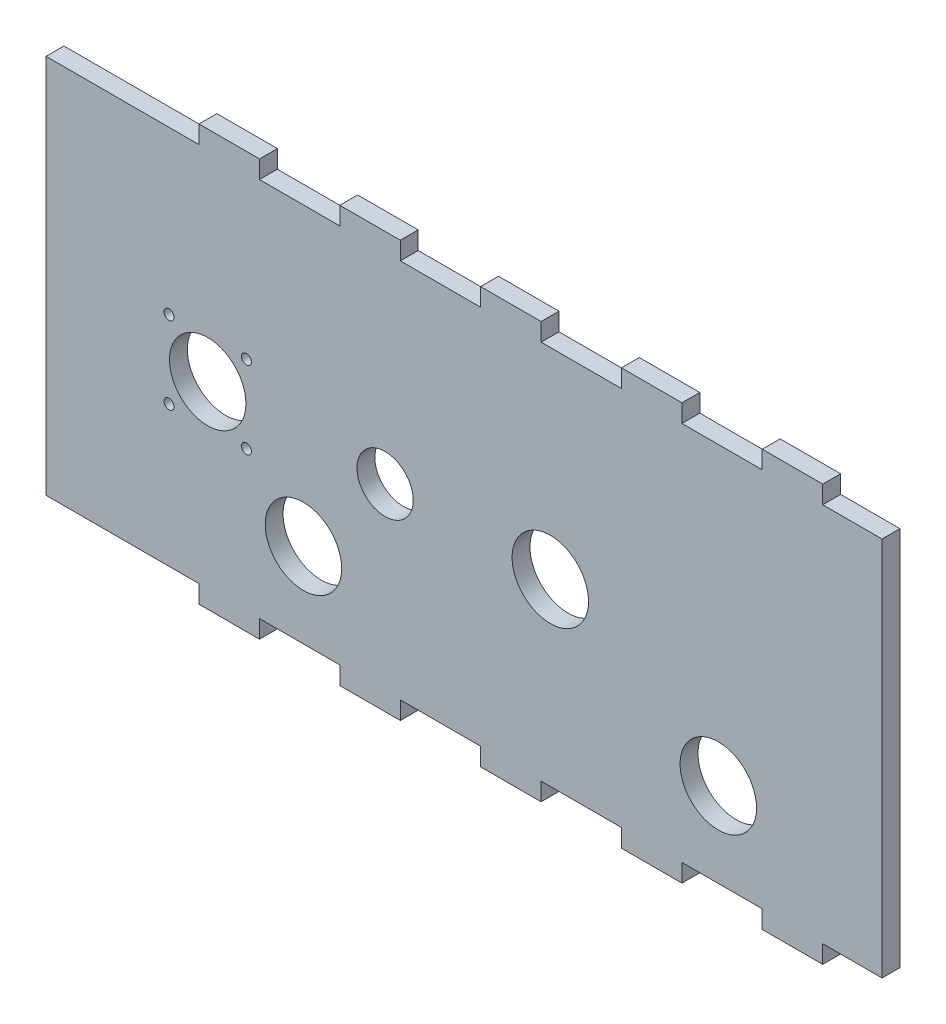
from build123d import *

# Parameters (mm, degrees)
SKETCH1_R           = 13.575
SKETCH1_R_2         = 1.778
SKETCH1_R_3         = 10
BOSS_EXTRUDE1_DEPTH = 6.35


with BuildPart() as part:
    # Sketch1 → Boss-Extrude1 (new body)
    with BuildSketch(Plane.XY):
        Polygon((0, 0), (54.3, 0), (54.3, -6.35), (75.785, -6.35), (75.785, 0), (104.3, 0), (104.3, -6.35), (125.785, -6.35), (125.785, 0), (154.3, 0), (154.3, -6.35), (175.785, -6.35), (175.785, 0), (204.3, 0), (204.3, -6.35), (225.785, -6.35), (225.785, 0), (254.3, 0), (254.3, -6.35), (275.785, -6.35), (275.785, 0), (296.845, 0), (296.845, 135), (275.785, 135), (275.785, 141.35), (254.3, 141.35), (254.3, 135), (225.785, 135), (225.785, 141.35), (204.3, 141.35), (204.3, 135), (175.785, 135), (175.785, 141.35), (154.3, 141.35), (154.3, 135), (125.785, 135), (125.785, 141.35), (104.3, 141.35), (104.3, 135), (75.785, 135), (75.785, 141.35), (54.3, 141.35), (54.3, 135), (0, 135), align=None)
        with Locations((91.3825, 30)):
            Circle(SKETCH1_R, mode=Mode.SUBTRACT)
        with Locations((238.7025, 30)):
            Circle(SKETCH1_R, mode=Mode.SUBTRACT)
        with Locations((179.048874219, 63.670386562)):
            Circle(SKETCH1_R, mode=Mode.SUBTRACT)
        with Locations((57.388874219, 63.670386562)):
            Circle(SKETCH1_R, mode=Mode.SUBTRACT)
        with Locations((43.640102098, 77.419158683)):
            Circle(SKETCH1_R_2, mode=Mode.SUBTRACT)
        with Locations((43.640102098, 49.921614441)):
            Circle(SKETCH1_R_2, mode=Mode.SUBTRACT)
        with Locations((71.137646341, 77.419158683)):
            Circle(SKETCH1_R_2, mode=Mode.SUBTRACT)
        with Locations((71.137646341, 49.921614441)):
            Circle(SKETCH1_R_2, mode=Mode.SUBTRACT)
        with Locations((120.388874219, 63.670386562)):
            Circle(SKETCH1_R_3, mode=Mode.SUBTRACT)
    extrude(amount=BOSS_EXTRUDE1_DEPTH)


solid = part.part
